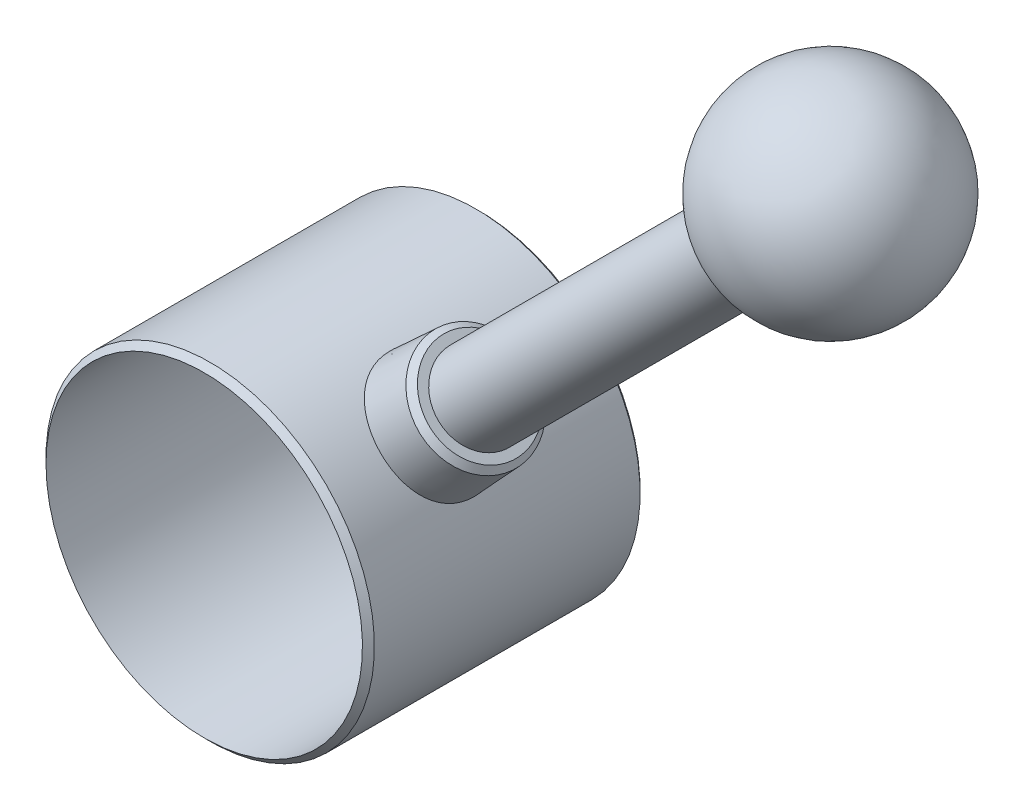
ISO-10303-21;
HEADER;
FILE_DESCRIPTION(('STEP AP214'),'2;1');
FILE_NAME('part.step','',(''),(''),'','','');
FILE_SCHEMA(('AUTOMOTIVE_DESIGN { 1 0 10303 214 1 1 1 1 }'));
ENDSEC;
DATA;
#1=APPLICATION_CONTEXT('core data for automotive mechanical design processes');
#2=APPLICATION_PROTOCOL_DEFINITION('international standard','automotive_design',2000,#1);
#3=PRODUCT_CONTEXT('',#1,'mechanical');
#4=PRODUCT('Part','Part','',(#3));
#5=PRODUCT_RELATED_PRODUCT_CATEGORY('part','',(#4));
#6=PRODUCT_DEFINITION_FORMATION('','',#4);
#7=PRODUCT_DEFINITION_CONTEXT('part definition',#1,'design');
#8=PRODUCT_DEFINITION('design','',#6,#7);
#9=PRODUCT_DEFINITION_SHAPE('','',#8);
#10=(LENGTH_UNIT() NAMED_UNIT(*) SI_UNIT(.MILLI.,.METRE.));
#11=(NAMED_UNIT(*) PLANE_ANGLE_UNIT() SI_UNIT($,.RADIAN.));
#12=(NAMED_UNIT(*) SI_UNIT($,.STERADIAN.) SOLID_ANGLE_UNIT());
#13=UNCERTAINTY_MEASURE_WITH_UNIT(LENGTH_MEASURE(1.E-05),#10,'distance_accuracy_value','');
#14=(GEOMETRIC_REPRESENTATION_CONTEXT(3) GLOBAL_UNCERTAINTY_ASSIGNED_CONTEXT((#13)) GLOBAL_UNIT_ASSIGNED_CONTEXT((#10,
#11,#12)) REPRESENTATION_CONTEXT('',''));
#15=CARTESIAN_POINT('',(0.,0.,0.));
#16=DIRECTION('',(0.,0.,1.));
#17=DIRECTION('',(1.,0.,0.));
#18=AXIS2_PLACEMENT_3D('',#15,#16,#17);
#19=CARTESIAN_POINT('',(12.4834021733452,12.4834021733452,26.));
#20=DIRECTION('',(-0.707106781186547,-0.707106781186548,0.));
#21=DIRECTION('',(-0.707106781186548,0.707106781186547,0.));
#22=AXIS2_PLACEMENT_3D('',#19,#20,#21);
#23=CONICAL_SURFACE('',#22,10.2896247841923,0.0407937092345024);
#24=CARTESIAN_POINT('',(25.4558441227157,25.4558441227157,26.));
#25=DIRECTION('',(-0.707106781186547,-0.707106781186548,0.));
#26=DIRECTION('',(-0.707106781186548,0.707106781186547,0.));
#27=AXIS2_PLACEMENT_3D('',#24,#25,#26);
#28=CIRCLE('',#27,9.540816);
#29=CARTESIAN_POINT('',(18.7094684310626,32.2022198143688,26.));
#30=VERTEX_POINT('',#29);
#31=EDGE_CURVE('E8',#30,#30,#28,.T.);
#32=ORIENTED_EDGE('',*,*,#31,.T.);
#33=EDGE_LOOP('',(#32));
#34=FACE_BOUND('',#33,.T.);
#35=CARTESIAN_POINT('',(13.627864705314,23.8857971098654,32.778107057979));
#36=CARTESIAN_POINT('',(13.8007103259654,23.7871811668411,32.9803831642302));
#37=CARTESIAN_POINT('',(13.9796382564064,23.6826061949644,33.1745535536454));
#38=CARTESIAN_POINT('',(14.3477728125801,23.4614049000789,33.5455097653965));
#39=CARTESIAN_POINT('',(14.5369793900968,23.3447786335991,33.7222956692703));
#40=CARTESIAN_POINT('',(14.9237692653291,23.0994275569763,34.0573487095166));
#41=CARTESIAN_POINT('',(15.1213525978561,22.9707026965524,34.2156157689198));
#42=CARTESIAN_POINT('',(15.5228941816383,22.7012814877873,34.5124752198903));
#43=CARTESIAN_POINT('',(15.7268500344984,22.5605896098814,34.6510749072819));
#44=CARTESIAN_POINT('',(16.1397219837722,22.2670981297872,34.9079082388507));
#45=CARTESIAN_POINT('',(16.3486482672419,22.1142718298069,35.0260950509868));
#46=CARTESIAN_POINT('',(16.7690236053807,21.7972279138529,35.2407320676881));
#47=CARTESIAN_POINT('',(16.9804726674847,21.6330102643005,35.3371822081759));
#48=CARTESIAN_POINT('',(17.4038372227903,21.2938954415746,35.5074488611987));
#49=CARTESIAN_POINT('',(17.6157525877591,21.1190009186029,35.5812709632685));
#50=CARTESIAN_POINT('',(18.0381114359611,20.7594181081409,35.7055916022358));
#51=CARTESIAN_POINT('',(18.2485549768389,20.5747302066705,35.7560910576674));
#52=CARTESIAN_POINT('',(18.6580420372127,20.2039800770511,35.8317719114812));
#53=CARTESIAN_POINT('',(18.8572134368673,20.0182415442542,35.857849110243));
#54=CARTESIAN_POINT('',(19.2507917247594,19.6400481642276,35.8877008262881));
#55=CARTESIAN_POINT('',(19.4451987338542,19.4475934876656,35.8914759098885));
#56=CARTESIAN_POINT('',(19.827735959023,19.0574269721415,35.8766873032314));
#57=CARTESIAN_POINT('',(20.015866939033,18.859715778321,35.8581263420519));
#58=CARTESIAN_POINT('',(20.3845585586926,18.4605953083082,35.7988543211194));
#59=CARTESIAN_POINT('',(20.5651192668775,18.2591860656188,35.7581434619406));
#60=CARTESIAN_POINT('',(20.9125518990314,17.8601003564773,35.6564303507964));
#61=CARTESIAN_POINT('',(21.0796667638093,17.6624799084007,35.5960359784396));
#62=CARTESIAN_POINT('',(21.4049219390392,17.2668734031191,35.4552098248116));
#63=CARTESIAN_POINT('',(21.563059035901,17.0688872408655,35.3747709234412));
#64=CARTESIAN_POINT('',(21.8696134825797,16.6743040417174,35.1945503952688));
#65=CARTESIAN_POINT('',(22.0180334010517,16.4777066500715,35.0947739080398));
#66=CARTESIAN_POINT('',(22.3048006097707,16.0874032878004,34.8765838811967));
#67=CARTESIAN_POINT('',(22.4431439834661,15.8936984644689,34.7581631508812));
#68=CARTESIAN_POINT('',(22.7136496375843,15.504773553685,34.4994856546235));
#69=CARTESIAN_POINT('',(22.8454748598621,15.3097015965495,34.3586536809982));
#70=CARTESIAN_POINT('',(23.0979236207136,14.9261072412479,34.0589603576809));
#71=CARTESIAN_POINT('',(23.2185420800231,14.7375878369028,33.9000909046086));
#72=CARTESIAN_POINT('',(23.4484946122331,14.3689008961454,33.5653583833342));
#73=CARTESIAN_POINT('',(23.5578275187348,14.1887342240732,33.3894935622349));
#74=CARTESIAN_POINT('',(23.7652630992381,13.8384863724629,33.0218182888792));
#75=CARTESIAN_POINT('',(23.8633655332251,13.6684054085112,32.830007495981));
#76=CARTESIAN_POINT('',(24.0528868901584,13.3322026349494,32.4220105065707));
#77=CARTESIAN_POINT('',(24.1437646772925,13.1666555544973,32.2050983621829));
#78=CARTESIAN_POINT('',(24.3135085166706,12.8505056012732,31.7563354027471));
#79=CARTESIAN_POINT('',(24.3923790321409,12.6998971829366,31.524490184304));
#80=CARTESIAN_POINT('',(24.5384000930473,12.41541396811,31.047095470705));
#81=CARTESIAN_POINT('',(24.60554608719,12.2815456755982,30.8015407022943));
#82=CARTESIAN_POINT('',(24.7282708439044,12.0325347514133,30.2984714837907));
#83=CARTESIAN_POINT('',(24.7838548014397,11.9173837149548,30.0409624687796));
#84=CARTESIAN_POINT('',(24.8830050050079,11.7089371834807,29.5192272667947));
#85=CARTESIAN_POINT('',(24.9267257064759,11.6153634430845,29.2551417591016));
#86=CARTESIAN_POINT('',(25.0033029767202,11.4495934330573,28.7187966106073));
#87=CARTESIAN_POINT('',(25.0361595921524,11.3773970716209,28.4465370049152));
#88=CARTESIAN_POINT('',(25.0911167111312,11.2556798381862,27.896069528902));
#89=CARTESIAN_POINT('',(25.1132227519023,11.2061472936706,27.6178647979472));
#90=CARTESIAN_POINT('',(25.146785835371,11.1306281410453,27.0576467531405));
#91=CARTESIAN_POINT('',(25.158243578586,11.1046399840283,26.775633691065));
#92=CARTESIAN_POINT('',(25.1701347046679,11.0776579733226,26.2295191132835));
#93=CARTESIAN_POINT('',(25.1712676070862,11.0750782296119,25.9655098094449));
#94=CARTESIAN_POINT('',(25.1643332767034,11.0908253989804,25.4382456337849));
#95=CARTESIAN_POINT('',(25.1562664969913,11.1091512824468,25.1749907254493));
#96=CARTESIAN_POINT('',(25.1309075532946,11.1663986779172,24.6511947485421));
#97=CARTESIAN_POINT('',(25.1136157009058,11.2053194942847,24.3906535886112));
#98=CARTESIAN_POINT('',(25.0697501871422,11.303118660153,23.8741428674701));
#99=CARTESIAN_POINT('',(25.0431764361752,11.3619972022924,23.618173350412));
#100=CARTESIAN_POINT('',(24.9812499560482,11.4975033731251,23.1173154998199));
#101=CARTESIAN_POINT('',(24.9460718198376,11.5737761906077,22.8723092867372));
#102=CARTESIAN_POINT('',(24.8665748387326,11.7436042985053,22.3897975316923));
#103=CARTESIAN_POINT('',(24.8222527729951,11.8371656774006,22.1522946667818));
#104=CARTESIAN_POINT('',(24.7243436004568,12.0403297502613,21.6862400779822));
#105=CARTESIAN_POINT('',(24.6707565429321,12.1499323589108,21.4576883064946));
#106=CARTESIAN_POINT('',(24.5541632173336,12.3838662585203,21.0107408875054));
#107=CARTESIAN_POINT('',(24.4911562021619,12.508198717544,20.7923460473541));
#108=CARTESIAN_POINT('',(24.3515571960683,12.7779520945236,20.3542632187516));
#109=CARTESIAN_POINT('',(24.2743827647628,12.9241846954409,20.1352601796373));
#110=CARTESIAN_POINT('',(24.1090979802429,13.229950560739,19.7111047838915));
#111=CARTESIAN_POINT('',(24.0209872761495,13.3894842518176,19.5059528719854));
#112=CARTESIAN_POINT('',(23.8336291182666,13.7202130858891,19.1105617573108));
#113=CARTESIAN_POINT('',(23.734378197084,13.8914118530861,18.920327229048));
#114=CARTESIAN_POINT('',(23.5246359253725,14.2437189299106,18.5559149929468));
#115=CARTESIAN_POINT('',(23.4141446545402,14.4248271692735,18.3817371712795));
#116=CARTESIAN_POINT('',(23.1759418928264,14.8046777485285,18.0420277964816));
#117=CARTESIAN_POINT('',(23.04764015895,15.0038484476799,17.8773875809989));
#118=CARTESIAN_POINT('',(22.7786551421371,15.4091530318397,17.5681968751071));
#119=CARTESIAN_POINT('',(22.637976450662,15.6152843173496,17.4236389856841));
#120=CARTESIAN_POINT('',(22.3443991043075,16.032557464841,17.1556412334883));
#121=CARTESIAN_POINT('',(22.1914995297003,16.2436997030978,17.0322029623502));
#122=CARTESIAN_POINT('',(21.8739129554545,16.668903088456,16.8075048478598));
#123=CARTESIAN_POINT('',(21.7092264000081,16.8829641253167,16.7062441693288));
#124=CARTESIAN_POINT('',(21.3725212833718,17.3071375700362,16.5288306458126));
#125=CARTESIAN_POINT('',(21.200748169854,17.5172315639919,16.4521681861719));
#126=CARTESIAN_POINT('',(20.8474170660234,17.9362844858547,16.32165547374));
#127=CARTESIAN_POINT('',(20.665859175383,18.1452434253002,16.2678049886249));
#128=CARTESIAN_POINT('',(20.2941172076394,18.560074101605,16.183469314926));
#129=CARTESIAN_POINT('',(20.1039356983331,18.7659467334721,16.1529772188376));
#130=CARTESIAN_POINT('',(19.7162381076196,19.1728692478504,16.1156513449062));
#131=CARTESIAN_POINT('',(19.5187223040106,19.3739193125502,16.1088166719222));
#132=CARTESIAN_POINT('',(19.1277700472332,19.7598106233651,16.1186259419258));
#133=CARTESIAN_POINT('',(18.9346107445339,19.9449627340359,16.1341316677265));
#134=CARTESIAN_POINT('',(18.5445382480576,20.3081538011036,16.1864417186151));
#135=CARTESIAN_POINT('',(18.3476251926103,20.4861930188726,16.2232452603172));
#136=CARTESIAN_POINT('',(17.9516182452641,20.834079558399,16.3178072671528));
#137=CARTESIAN_POINT('',(17.7525243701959,21.0039269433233,16.3755655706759));
#138=CARTESIAN_POINT('',(17.3537889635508,21.3345515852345,16.5115221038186));
#139=CARTESIAN_POINT('',(17.1541474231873,21.4953286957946,16.5897206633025));
#140=CARTESIAN_POINT('',(16.7559578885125,21.8071511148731,16.7659124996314));
#141=CARTESIAN_POINT('',(16.5574100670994,21.9581949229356,16.8639088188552));
#142=CARTESIAN_POINT('',(16.1630406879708,22.2500860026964,17.0789596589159));
#143=CARTESIAN_POINT('',(15.9672201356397,22.3909295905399,17.1960210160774));
#144=CARTESIAN_POINT('',(15.5800361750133,22.6620461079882,17.4483334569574));
#145=CARTESIAN_POINT('',(15.388672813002,22.79231892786,17.583584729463));
#146=CARTESIAN_POINT('',(15.0120347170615,23.0421329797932,17.8713861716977));
#147=CARTESIAN_POINT('',(14.8267603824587,23.1616735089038,18.0239374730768));
#148=CARTESIAN_POINT('',(14.4550516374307,23.3955557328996,18.3532686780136));
#149=CARTESIAN_POINT('',(14.269003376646,23.5093575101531,18.5308684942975));
#150=CARTESIAN_POINT('',(13.9072413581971,23.725155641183,18.9029662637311));
#151=CARTESIAN_POINT('',(13.7315278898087,23.8271516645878,19.0974646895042));
#152=CARTESIAN_POINT('',(13.3922174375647,24.0195038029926,19.5022728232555));
#153=CARTESIAN_POINT('',(13.2286241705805,24.1098563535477,19.7125873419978));
#154=CARTESIAN_POINT('',(12.9154422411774,24.2790658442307,20.1477566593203));
#155=CARTESIAN_POINT('',(12.7658530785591,24.3579231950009,20.3726109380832));
#156=CARTESIAN_POINT('',(12.4786970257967,24.5063040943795,20.8417404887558));
#157=CARTESIAN_POINT('',(12.3415562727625,24.5755232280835,21.08637344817));
#158=CARTESIAN_POINT('',(12.0858832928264,24.7022628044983,21.5879556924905));
#159=CARTESIAN_POINT('',(11.9673433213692,24.7597881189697,21.844899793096));
#160=CARTESIAN_POINT('',(11.7506225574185,24.8633727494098,22.3694315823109));
#161=CARTESIAN_POINT('',(11.6524386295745,24.9094338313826,22.6370176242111));
#162=CARTESIAN_POINT('',(11.4780473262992,24.9902717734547,23.1809152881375));
#163=CARTESIAN_POINT('',(11.401838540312,25.0250493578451,23.4572263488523));
#164=CARTESIAN_POINT('',(11.2759163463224,25.0820304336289,24.0027466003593));
#165=CARTESIAN_POINT('',(11.2250909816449,25.1047649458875,24.2716438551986));
#166=CARTESIAN_POINT('',(11.1454376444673,25.1402293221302,24.8133317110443));
#167=CARTESIAN_POINT('',(11.116608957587,25.1529595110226,25.0861221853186));
#168=CARTESIAN_POINT('',(11.0814754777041,25.1684578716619,25.6333313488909));
#169=CARTESIAN_POINT('',(11.0751623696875,25.1712297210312,25.9077493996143));
#170=CARTESIAN_POINT('',(11.0851539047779,25.1668312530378,26.4560890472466));
#171=CARTESIAN_POINT('',(11.1014578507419,25.1596612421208,26.730010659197));
#172=CARTESIAN_POINT('',(11.1547937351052,25.1360569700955,27.2594076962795));
#173=CARTESIAN_POINT('',(11.1905751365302,25.1201812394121,27.5150353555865));
#174=CARTESIAN_POINT('',(11.2813798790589,25.079532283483,28.0221129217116));
#175=CARTESIAN_POINT('',(11.3364021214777,25.0547595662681,28.2735630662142));
#176=CARTESIAN_POINT('',(11.464878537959,24.996230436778,28.7707125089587));
#177=CARTESIAN_POINT('',(11.5383381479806,24.9624713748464,29.0164100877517));
#178=CARTESIAN_POINT('',(11.7026423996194,24.8858668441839,29.5004767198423));
#179=CARTESIAN_POINT('',(11.7934887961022,24.843020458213,29.7388450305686));
#180=CARTESIAN_POINT('',(12.0020925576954,24.7429699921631,30.2322213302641));
#181=CARTESIAN_POINT('',(12.1216987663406,24.6847135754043,30.4862360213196));
#182=CARTESIAN_POINT('',(12.3790261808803,24.5566763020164,30.9818887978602));
#183=CARTESIAN_POINT('',(12.5167490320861,24.4868943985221,31.2235257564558));
#184=CARTESIAN_POINT('',(12.8084682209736,24.3355734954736,31.6929614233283));
#185=CARTESIAN_POINT('',(12.9624679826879,24.2540320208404,31.9207572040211));
#186=CARTESIAN_POINT('',(13.2848611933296,24.0789557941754,32.3611650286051));
#187=CARTESIAN_POINT('',(13.4532595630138,23.9854169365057,32.5737718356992));
#188=CARTESIAN_POINT('',(13.627864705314,23.8857971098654,32.778107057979));
#189=B_SPLINE_CURVE_WITH_KNOTS('',3,(#35,#36,#37,#38,#39,#40,#41,#42,#43,#44,#45,#46,#47,#48,
#49,#50,#51,#52,#53,#54,#55,#56,#57,#58,#59,#60,#61,#62,#63,#64,#65,#66,#67,#68,#69,#70,#71,#72,
#73,#74,#75,#76,#77,#78,#79,#80,#81,#82,#83,#84,#85,#86,#87,#88,#89,#90,#91,#92,#93,#94,#95,#96,
#97,#98,#99,#100,#101,#102,#103,#104,#105,#106,#107,#108,#109,#110,#111,#112,#113,#114,#115,
#116,#117,#118,#119,#120,#121,#122,#123,#124,#125,#126,#127,#128,#129,#130,#131,#132,#133,#134,
#135,#136,#137,#138,#139,#140,#141,#142,#143,#144,#145,#146,#147,#148,#149,#150,#151,#152,#153,
#154,#155,#156,#157,#158,#159,#160,#161,#162,#163,#164,#165,#166,#167,#168,#169,#170,#171,#172,
#173,#174,#175,#176,#177,#178,#179,#180,#181,#182,#183,#184,#185,#186,#187,#188),.UNSPECIFIED.,
.T.,.F.,(4,2,2,2,2,2,2,2,2,2,2,2,2,2,2,2,2,2,2,2,2,2,2,2,2,2,2,2,2,2,2,2,2,2,2,2,2,2,2,2,2,2,2,
2,2,2,2,2,2,2,2,2,2,2,2,2,2,2,2,2,2,2,2,2,2,2,2,2,2,2,2,2,2,2,2,2,4),(0.,0.851015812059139,
1.70202763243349,2.55304298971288,3.40374182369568,4.2563671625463,5.10899501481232,
5.96141208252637,6.8137955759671,7.63352499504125,8.45323359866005,9.27284205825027,
10.0924430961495,10.8888121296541,11.6854644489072,12.4819053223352,13.2786541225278,
14.1007714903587,14.9232596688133,15.7458327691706,16.5684234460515,17.4302066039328,
18.2916686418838,19.1534643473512,20.0148719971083,20.8644582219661,21.7140407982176,
22.5631853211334,23.412273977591,24.2033694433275,24.9944259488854,25.7854557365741,
26.576493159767,27.3526464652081,28.1290736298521,28.9054966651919,29.6819813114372,
30.504310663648,31.3266664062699,32.1492788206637,32.9718854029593,33.8363620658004,
34.7005193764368,35.5647417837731,36.4289316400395,37.2738472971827,38.1187543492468,
38.963411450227,39.8080365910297,40.6111204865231,41.4141748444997,42.2172230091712,
43.0202841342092,43.8234687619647,44.6269420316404,45.4304236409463,46.2339578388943,
47.0767776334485,47.9196210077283,48.7627217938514,49.6057924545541,50.4713099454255,
51.3364661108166,52.2014889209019,53.0664561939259,53.8891917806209,54.7119006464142,
55.5343056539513,56.3566853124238,57.1316045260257,57.9064794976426,58.6815831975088,
59.456765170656,60.3158900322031,61.1750929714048,62.0344770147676,62.8941559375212),.UNSPECIFIED.);
#190=CARTESIAN_POINT('',(13.627864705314,23.8857971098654,32.778107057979));
#191=VERTEX_POINT('',#190);
#192=EDGE_CURVE('E16',#191,#191,#189,.T.);
#193=ORIENTED_EDGE('',*,*,#192,.T.);
#194=EDGE_LOOP('',(#193));
#195=FACE_BOUND('',#194,.T.);
#196=ADVANCED_FACE('F12',(#34,#195),#23,.T.);
#197=CARTESIAN_POINT('',(25.4558441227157,25.4558441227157,26.));
#198=DIRECTION('',(-0.707106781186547,-0.707106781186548,0.));
#199=DIRECTION('',(-0.707106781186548,0.707106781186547,0.));
#200=AXIS2_PLACEMENT_3D('',#197,#198,#199);
#201=CONICAL_SURFACE('',#200,9.540816,0.785398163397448);
#202=CARTESIAN_POINT('',(26.1629509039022,26.1629509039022,26.));
#203=DIRECTION('',(-0.707106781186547,-0.707106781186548,0.));
#204=DIRECTION('',(-0.707106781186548,0.707106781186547,0.));
#205=AXIS2_PLACEMENT_3D('',#202,#203,#204);
#206=CIRCLE('',#205,8.540816);
#207=CARTESIAN_POINT('',(20.1236819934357,32.2022198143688,26.));
#208=VERTEX_POINT('',#207);
#209=EDGE_CURVE('E24',#208,#208,#206,.T.);
#210=ORIENTED_EDGE('',*,*,#209,.T.);
#211=EDGE_LOOP('',(#210));
#212=FACE_BOUND('',#211,.T.);
#213=ORIENTED_EDGE('',*,*,#31,.F.);
#214=EDGE_LOOP('',(#213));
#215=FACE_BOUND('',#214,.T.);
#216=ADVANCED_FACE('F90',(#212,#215),#201,.T.);
#217=CARTESIAN_POINT('',(26.1629509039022,26.1629509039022,17.459184));
#218=DIRECTION('',(0.707106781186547,0.707106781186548,0.));
#219=DIRECTION('',(0.707106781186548,-0.707106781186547,0.));
#220=AXIS2_PLACEMENT_3D('',#217,#218,#219);
#221=PLANE('',#220);
#222=CARTESIAN_POINT('',(26.1629509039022,26.1629509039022,26.));
#223=DIRECTION('',(-0.707106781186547,-0.707106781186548,0.));
#224=DIRECTION('',(-0.707106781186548,0.707106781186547,0.));
#225=AXIS2_PLACEMENT_3D('',#222,#223,#224);
#226=CIRCLE('',#225,7.);
#227=CARTESIAN_POINT('',(21.2132034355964,31.1126983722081,26.));
#228=VERTEX_POINT('',#227);
#229=EDGE_CURVE('E28',#228,#228,#226,.T.);
#230=ORIENTED_EDGE('',*,*,#229,.T.);
#231=EDGE_LOOP('',(#230));
#232=FACE_BOUND('',#231,.T.);
#233=ORIENTED_EDGE('',*,*,#209,.F.);
#234=EDGE_LOOP('',(#233));
#235=FACE_BOUND('',#234,.T.);
#236=ADVANCED_FACE('F95',(#232,#235),#221,.T.);
#237=CARTESIAN_POINT('',(-22.9809703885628,-22.9809703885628,26.));
#238=DIRECTION('',(-0.707106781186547,-0.707106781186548,0.));
#239=DIRECTION('',(-0.707106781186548,0.707106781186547,0.));
#240=AXIS2_PLACEMENT_3D('',#237,#238,#239);
#241=CYLINDRICAL_SURFACE('',#240,7.);
#242=CARTESIAN_POINT('',(73.8926586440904,73.8926586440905,26.));
#243=DIRECTION('',(-0.707106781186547,-0.707106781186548,0.));
#244=DIRECTION('',(-0.707106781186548,0.707106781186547,0.));
#245=AXIS2_PLACEMENT_3D('',#242,#243,#244);
#246=CIRCLE('',#245,7.);
#247=CARTESIAN_POINT('',(68.9429111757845,78.8424061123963,26.));
#248=VERTEX_POINT('',#247);
#249=EDGE_CURVE('E33',#248,#248,#246,.T.);
#250=ORIENTED_EDGE('',*,*,#249,.T.);
#251=EDGE_LOOP('',(#250));
#252=FACE_BOUND('',#251,.T.);
#253=ORIENTED_EDGE('',*,*,#229,.F.);
#254=EDGE_LOOP('',(#253));
#255=FACE_BOUND('',#254,.T.);
#256=ADVANCED_FACE('F104',(#252,#255),#241,.T.);
#257=CARTESIAN_POINT('',(73.8926586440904,73.8926586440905,17.8759615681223));
#258=DIRECTION('',(-0.707106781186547,-0.707106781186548,0.));
#259=DIRECTION('',(-0.707106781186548,0.707106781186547,0.));
#260=AXIS2_PLACEMENT_3D('',#257,#258,#259);
#261=PLANE('',#260);
#262=CARTESIAN_POINT('',(73.8926586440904,73.8926586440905,26.));
#263=DIRECTION('',(-0.707106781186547,-0.707106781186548,0.));
#264=DIRECTION('',(-0.707106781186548,0.707106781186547,0.));
#265=AXIS2_PLACEMENT_3D('',#262,#263,#264);
#266=CIRCLE('',#265,8.12403843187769);
#267=CARTESIAN_POINT('',(68.1480959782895,79.6372213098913,26.));
#268=VERTEX_POINT('',#267);
#269=EDGE_CURVE('E36',#268,#268,#266,.T.);
#270=ORIENTED_EDGE('',*,*,#269,.T.);
#271=EDGE_LOOP('',(#270));
#272=FACE_BOUND('',#271,.T.);
#273=ORIENTED_EDGE('',*,*,#249,.F.);
#274=EDGE_LOOP('',(#273));
#275=FACE_BOUND('',#274,.T.);
#276=ADVANCED_FACE('F86',(#272,#275),#261,.T.);
#277=CARTESIAN_POINT('',(84.8528137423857,84.8528137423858,26.));
#278=DIRECTION('',(-0.707106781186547,-0.707106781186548,0.));
#279=DIRECTION('',(0.,0.,-1.));
#280=AXIS2_PLACEMENT_3D('',#277,#278,#279);
#281=SPHERICAL_SURFACE('',#280,17.5);
#282=ORIENTED_EDGE('',*,*,#269,.F.);
#283=EDGE_LOOP('',(#282));
#284=FACE_BOUND('',#283,.T.);
#285=ADVANCED_FACE('F78',(#284),#281,.T.);
#286=CARTESIAN_POINT('',(0.,0.,46.5));
#287=DIRECTION('',(0.,0.,-1.));
#288=DIRECTION('',(-0.707106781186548,0.707106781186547,0.));
#289=AXIS2_PLACEMENT_3D('',#286,#287,#288);
#290=CONICAL_SURFACE('',#289,26.,0.785398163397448);
#291=CARTESIAN_POINT('',(0.,0.,46.));
#292=DIRECTION('',(0.,0.,-1.));
#293=DIRECTION('',(-1.,0.,0.));
#294=AXIS2_PLACEMENT_3D('',#291,#292,#293);
#295=CIRCLE('',#294,26.5);
#296=CARTESIAN_POINT('',(-26.5,0.,46.));
#297=VERTEX_POINT('',#296);
#298=EDGE_CURVE('E48',#297,#297,#295,.T.);
#299=ORIENTED_EDGE('',*,*,#298,.T.);
#300=EDGE_LOOP('',(#299));
#301=FACE_BOUND('',#300,.T.);
#302=CARTESIAN_POINT('',(0.,0.,45.));
#303=DIRECTION('',(0.,0.,-1.));
#304=DIRECTION('',(-0.707106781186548,0.707106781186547,0.));
#305=AXIS2_PLACEMENT_3D('',#302,#303,#304);
#306=CIRCLE('',#305,27.5);
#307=CARTESIAN_POINT('',(-19.4454364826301,19.44543648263,45.));
#308=VERTEX_POINT('',#307);
#309=EDGE_CURVE('E39',#308,#308,#306,.T.);
#310=ORIENTED_EDGE('',*,*,#309,.F.);
#311=EDGE_LOOP('',(#310));
#312=FACE_BOUND('',#311,.T.);
#313=ADVANCED_FACE('F73',(#301,#312),#290,.T.);
#314=CARTESIAN_POINT('',(0.,0.,-5.));
#315=DIRECTION('',(0.,0.,-1.));
#316=DIRECTION('',(-0.707106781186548,0.707106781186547,0.));
#317=AXIS2_PLACEMENT_3D('',#314,#315,#316);
#318=CYLINDRICAL_SURFACE('',#317,27.5);
#319=ORIENTED_EDGE('',*,*,#192,.F.);
#320=EDGE_LOOP('',(#319));
#321=FACE_BOUND('',#320,.T.);
#322=CARTESIAN_POINT('',(0.,0.,0.499999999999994));
#323=DIRECTION('',(0.,0.,-1.));
#324=DIRECTION('',(-0.707106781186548,0.707106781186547,0.));
#325=AXIS2_PLACEMENT_3D('',#322,#323,#324);
#326=CIRCLE('',#325,27.5);
#327=CARTESIAN_POINT('',(-19.4454364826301,19.44543648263,0.499999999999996));
#328=VERTEX_POINT('',#327);
#329=EDGE_CURVE('E42',#328,#328,#326,.T.);
#330=ORIENTED_EDGE('',*,*,#329,.F.);
#331=EDGE_LOOP('',(#330));
#332=FACE_BOUND('',#331,.T.);
#333=ORIENTED_EDGE('',*,*,#309,.T.);
#334=EDGE_LOOP('',(#333));
#335=FACE_BOUND('',#334,.T.);
#336=ADVANCED_FACE('F67',(#321,#332,#335),#318,.T.);
#337=CARTESIAN_POINT('',(0.,0.,0.499999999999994));
#338=DIRECTION('',(0.,0.,1.));
#339=DIRECTION('',(0.707106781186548,-0.707106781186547,0.));
#340=AXIS2_PLACEMENT_3D('',#337,#338,#339);
#341=CONICAL_SURFACE('',#340,27.5,0.785398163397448);
#342=CARTESIAN_POINT('',(0.,0.,0.));
#343=DIRECTION('',(0.,0.,-1.));
#344=DIRECTION('',(-0.707106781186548,0.707106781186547,0.));
#345=AXIS2_PLACEMENT_3D('',#342,#343,#344);
#346=CIRCLE('',#345,27.);
#347=CARTESIAN_POINT('',(-19.0918830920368,19.0918830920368,0.));
#348=VERTEX_POINT('',#347);
#349=EDGE_CURVE('E45',#348,#348,#346,.T.);
#350=ORIENTED_EDGE('',*,*,#349,.F.);
#351=EDGE_LOOP('',(#350));
#352=FACE_BOUND('',#351,.T.);
#353=ORIENTED_EDGE('',*,*,#329,.T.);
#354=EDGE_LOOP('',(#353));
#355=FACE_BOUND('',#354,.T.);
#356=ADVANCED_FACE('F61',(#352,#355),#341,.T.);
#357=CARTESIAN_POINT('',(-19.0918830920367,-19.0918830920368,0.));
#358=DIRECTION('',(0.,0.,1.));
#359=DIRECTION('',(0.707106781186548,-0.707106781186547,0.));
#360=AXIS2_PLACEMENT_3D('',#357,#358,#359);
#361=PLANE('',#360);
#362=CARTESIAN_POINT('',(0.,0.,0.));
#363=DIRECTION('',(0.,0.,-1.));
#364=DIRECTION('',(-1.,0.,0.));
#365=AXIS2_PLACEMENT_3D('',#362,#363,#364);
#366=CIRCLE('',#365,26.5);
#367=CARTESIAN_POINT('',(-26.5,0.,0.));
#368=VERTEX_POINT('',#367);
#369=EDGE_CURVE('E51',#368,#368,#366,.T.);
#370=ORIENTED_EDGE('',*,*,#369,.F.);
#371=EDGE_LOOP('',(#370));
#372=FACE_BOUND('',#371,.T.);
#373=ORIENTED_EDGE('',*,*,#349,.T.);
#374=EDGE_LOOP('',(#373));
#375=FACE_BOUND('',#374,.T.);
#376=ADVANCED_FACE('F58',(#372,#375),#361,.F.);
#377=CARTESIAN_POINT('',(0.,0.,54.5));
#378=DIRECTION('',(0.,0.,-1.));
#379=DIRECTION('',(-1.,0.,0.));
#380=AXIS2_PLACEMENT_3D('',#377,#378,#379);
#381=CYLINDRICAL_SURFACE('',#380,26.5);
#382=ORIENTED_EDGE('',*,*,#369,.T.);
#383=EDGE_LOOP('',(#382));
#384=FACE_BOUND('',#383,.T.);
#385=ORIENTED_EDGE('',*,*,#298,.F.);
#386=EDGE_LOOP('',(#385));
#387=FACE_BOUND('',#386,.T.);
#388=ADVANCED_FACE('F55',(#384,#387),#381,.F.);
#389=CLOSED_SHELL('',(#196,#216,#236,#256,#276,#285,#313,#336,#356,#376,#388));
#390=MANIFOLD_SOLID_BREP('B1',#389);
#391=ADVANCED_BREP_SHAPE_REPRESENTATION('',(#18,#390),#14);
#392=SHAPE_DEFINITION_REPRESENTATION(#9,#391);
ENDSEC;
END-ISO-10303-21;
